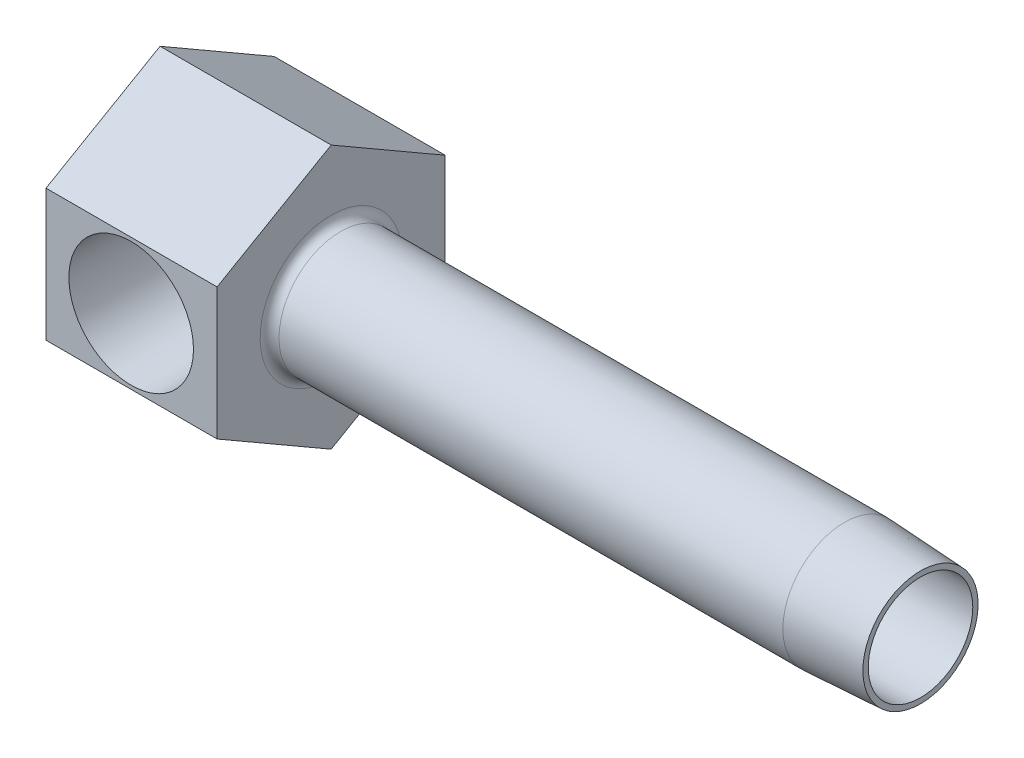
ISO-10303-21;
HEADER;
FILE_DESCRIPTION(('STEP AP214'),'2;1');
FILE_NAME('part.step','',(''),(''),'','','');
FILE_SCHEMA(('AUTOMOTIVE_DESIGN { 1 0 10303 214 1 1 1 1 }'));
ENDSEC;
DATA;
#1=APPLICATION_CONTEXT('core data for automotive mechanical design processes');
#2=APPLICATION_PROTOCOL_DEFINITION('international standard','automotive_design',2000,#1);
#3=PRODUCT_CONTEXT('',#1,'mechanical');
#4=PRODUCT('Part','Part','',(#3));
#5=PRODUCT_RELATED_PRODUCT_CATEGORY('part','',(#4));
#6=PRODUCT_DEFINITION_FORMATION('','',#4);
#7=PRODUCT_DEFINITION_CONTEXT('part definition',#1,'design');
#8=PRODUCT_DEFINITION('design','',#6,#7);
#9=PRODUCT_DEFINITION_SHAPE('','',#8);
#10=(LENGTH_UNIT() NAMED_UNIT(*) SI_UNIT(.MILLI.,.METRE.));
#11=(NAMED_UNIT(*) PLANE_ANGLE_UNIT() SI_UNIT($,.RADIAN.));
#12=(NAMED_UNIT(*) SI_UNIT($,.STERADIAN.) SOLID_ANGLE_UNIT());
#13=UNCERTAINTY_MEASURE_WITH_UNIT(LENGTH_MEASURE(1.E-05),#10,'distance_accuracy_value','');
#14=(GEOMETRIC_REPRESENTATION_CONTEXT(3) GLOBAL_UNCERTAINTY_ASSIGNED_CONTEXT((#13)) GLOBAL_UNIT_ASSIGNED_CONTEXT((#10,
#11,#12)) REPRESENTATION_CONTEXT('',''));
#15=CARTESIAN_POINT('',(0.,0.,0.));
#16=DIRECTION('',(0.,0.,1.));
#17=DIRECTION('',(1.,0.,0.));
#18=AXIS2_PLACEMENT_3D('',#15,#16,#17);
#19=CARTESIAN_POINT('',(7.14375,0.,9.525));
#20=DIRECTION('',(1.,0.,0.));
#21=DIRECTION('',(0.,0.,-1.));
#22=AXIS2_PLACEMENT_3D('',#19,#20,#21);
#23=PLANE('',#22);
#24=DIRECTION('',(0.,0.,1.));
#25=VECTOR('',#24,1.);
#26=CARTESIAN_POINT('',(7.14375,4.21628045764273,19.05));
#27=LINE('',#26,#25);
#28=CARTESIAN_POINT('',(7.14375,4.21628045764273,8.39289543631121));
#29=VERTEX_POINT('',#28);
#30=CARTESIAN_POINT('',(7.14375,4.21628045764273,10.16));
#31=VERTEX_POINT('',#30);
#32=EDGE_CURVE('E274',#29,#31,#27,.T.);
#33=ORIENTED_EDGE('',*,*,#32,.F.);
#34=CARTESIAN_POINT('',(7.14375,0.,9.525));
#35=DIRECTION('',(1.,0.,0.));
#36=DIRECTION('',(0.,0.,-1.));
#37=AXIS2_PLACEMENT_3D('',#34,#35,#36);
#38=CIRCLE('',#37,4.365625);
#39=CARTESIAN_POINT('',(7.14375,4.31919629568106,10.16));
#40=VERTEX_POINT('',#39);
#41=EDGE_CURVE('E162',#29,#40,#38,.T.);
#42=ORIENTED_EDGE('',*,*,#41,.T.);
#43=DIRECTION('',(0.,1.,0.));
#44=VECTOR('',#43,1.);
#45=CARTESIAN_POINT('',(7.14375,0.,10.16));
#46=LINE('',#45,#44);
#47=EDGE_CURVE('E153',#31,#40,#46,.T.);
#48=ORIENTED_EDGE('',*,*,#47,.F.);
#49=EDGE_LOOP('',(#33,#42,#48));
#50=FACE_BOUND('',#49,.T.);
#51=ADVANCED_FACE('F15',(#50),#23,.T.);
#52=CARTESIAN_POINT('',(63.5,0.,4.71428939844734));
#53=DIRECTION('',(-1.,0.,0.));
#54=DIRECTION('',(0.,0.,1.));
#55=AXIS2_PLACEMENT_3D('',#52,#53,#54);
#56=PLANE('',#55);
#57=CARTESIAN_POINT('',(63.5,0.,9.525));
#58=DIRECTION('',(-1.,0.,0.));
#59=DIRECTION('',(0.,0.,1.));
#60=AXIS2_PLACEMENT_3D('',#57,#58,#59);
#61=CIRCLE('',#60,4.81071060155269);
#62=CARTESIAN_POINT('',(63.5,0.,14.3357106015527));
#63=VERTEX_POINT('',#62);
#64=EDGE_CURVE('E172',#63,#63,#61,.T.);
#65=ORIENTED_EDGE('',*,*,#64,.F.);
#66=EDGE_LOOP('',(#65));
#67=FACE_BOUND('',#66,.T.);
#68=CARTESIAN_POINT('',(63.5,0.,9.525));
#69=DIRECTION('',(1.,0.,0.));
#70=DIRECTION('',(0.,0.,-1.));
#71=AXIS2_PLACEMENT_3D('',#68,#69,#70);
#72=CIRCLE('',#71,4.365625);
#73=CARTESIAN_POINT('',(63.5,0.,5.159375));
#74=VERTEX_POINT('',#73);
#75=EDGE_CURVE('E163',#74,#74,#72,.T.);
#76=ORIENTED_EDGE('',*,*,#75,.F.);
#77=EDGE_LOOP('',(#76));
#78=FACE_BOUND('',#77,.T.);
#79=ADVANCED_FACE('F118',(#67,#78),#56,.F.);
#80=CARTESIAN_POINT('',(14.2875,5.4992613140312,19.05));
#81=DIRECTION('',(0.,0.,-1.));
#82=DIRECTION('',(-1.,0.,0.));
#83=AXIS2_PLACEMENT_3D('',#80,#81,#82);
#84=PLANE('',#83);
#85=CARTESIAN_POINT('',(7.112,0.,19.05));
#86=DIRECTION('',(0.,0.,1.));
#87=DIRECTION('',(1.,0.,0.));
#88=AXIS2_PLACEMENT_3D('',#85,#86,#87);
#89=CIRCLE('',#88,5.2023645);
#90=CARTESIAN_POINT('',(12.3143645,0.,19.05));
#91=VERTEX_POINT('',#90);
#92=EDGE_CURVE('E265',#91,#91,#89,.T.);
#93=ORIENTED_EDGE('',*,*,#92,.F.);
#94=EDGE_LOOP('',(#93));
#95=FACE_BOUND('',#94,.T.);
#96=DIRECTION('',(0.,-1.,0.));
#97=VECTOR('',#96,1.);
#98=CARTESIAN_POINT('',(0.,5.4992613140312,19.05));
#99=LINE('',#98,#97);
#100=CARTESIAN_POINT('',(0.,5.4992613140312,19.05));
#101=VERTEX_POINT('',#100);
#102=CARTESIAN_POINT('',(0.,-5.49926131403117,19.05));
#103=VERTEX_POINT('',#102);
#104=EDGE_CURVE('E185',#101,#103,#99,.T.);
#105=ORIENTED_EDGE('',*,*,#104,.T.);
#106=DIRECTION('',(-1.,0.,0.));
#107=VECTOR('',#106,1.);
#108=CARTESIAN_POINT('',(14.2875,-5.49926131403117,19.05));
#109=LINE('',#108,#107);
#110=CARTESIAN_POINT('',(14.2875,-5.49926131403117,19.05));
#111=VERTEX_POINT('',#110);
#112=EDGE_CURVE('E208',#111,#103,#109,.T.);
#113=ORIENTED_EDGE('',*,*,#112,.F.);
#114=DIRECTION('',(0.,-1.,0.));
#115=VECTOR('',#114,1.);
#116=CARTESIAN_POINT('',(14.2875,5.4992613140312,19.05));
#117=LINE('',#116,#115);
#118=CARTESIAN_POINT('',(14.2875,5.4992613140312,19.05));
#119=VERTEX_POINT('',#118);
#120=EDGE_CURVE('E201',#119,#111,#117,.T.);
#121=ORIENTED_EDGE('',*,*,#120,.F.);
#122=DIRECTION('',(-1.,0.,0.));
#123=VECTOR('',#122,1.);
#124=CARTESIAN_POINT('',(14.2875,5.4992613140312,19.05));
#125=LINE('',#124,#123);
#126=EDGE_CURVE('E211',#119,#101,#125,.T.);
#127=ORIENTED_EDGE('',*,*,#126,.T.);
#128=EDGE_LOOP('',(#105,#113,#121,#127));
#129=FACE_BOUND('',#128,.T.);
#130=ADVANCED_FACE('F126',(#95,#129),#84,.F.);
#131=CARTESIAN_POINT('',(14.2875,-5.49926131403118,0.));
#132=DIRECTION('',(1.,0.,0.));
#133=DIRECTION('',(0.,1.,0.));
#134=AXIS2_PLACEMENT_3D('',#131,#132,#133);
#135=PLANE('',#134);
#136=CARTESIAN_POINT('',(14.2875,0.,9.525));
#137=DIRECTION('',(1.,0.,0.));
#138=DIRECTION('',(0.,1.,0.));
#139=AXIS2_PLACEMENT_3D('',#136,#137,#138);
#140=CIRCLE('',#139,5.9309);
#141=CARTESIAN_POINT('',(14.2875,5.9309,9.525));
#142=VERTEX_POINT('',#141);
#143=EDGE_CURVE('E223',#142,#142,#140,.F.);
#144=ORIENTED_EDGE('',*,*,#143,.T.);
#145=EDGE_LOOP('',(#144));
#146=FACE_BOUND('',#145,.T.);
#147=DIRECTION('',(0.,0.5,-0.866025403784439));
#148=VECTOR('',#147,1.);
#149=CARTESIAN_POINT('',(14.2875,-10.9985226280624,9.525));
#150=LINE('',#149,#148);
#151=CARTESIAN_POINT('',(14.2875,-10.9985226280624,9.525));
#152=VERTEX_POINT('',#151);
#153=CARTESIAN_POINT('',(14.2875,-5.49926131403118,0.));
#154=VERTEX_POINT('',#153);
#155=EDGE_CURVE('E191',#152,#154,#150,.T.);
#156=ORIENTED_EDGE('',*,*,#155,.T.);
#157=DIRECTION('',(0.,1.,0.));
#158=VECTOR('',#157,1.);
#159=CARTESIAN_POINT('',(14.2875,-5.49926131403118,0.));
#160=LINE('',#159,#158);
#161=CARTESIAN_POINT('',(14.2875,5.49926131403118,0.));
#162=VERTEX_POINT('',#161);
#163=EDGE_CURVE('E195',#154,#162,#160,.T.);
#164=ORIENTED_EDGE('',*,*,#163,.T.);
#165=DIRECTION('',(0.,0.5,0.866025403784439));
#166=VECTOR('',#165,1.);
#167=CARTESIAN_POINT('',(14.2875,5.49926131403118,0.));
#168=LINE('',#167,#166);
#169=CARTESIAN_POINT('',(14.2875,10.9985226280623,9.525));
#170=VERTEX_POINT('',#169);
#171=EDGE_CURVE('E197',#162,#170,#168,.T.);
#172=ORIENTED_EDGE('',*,*,#171,.T.);
#173=DIRECTION('',(0.,-0.5,0.86602540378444));
#174=VECTOR('',#173,1.);
#175=CARTESIAN_POINT('',(14.2875,10.9985226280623,9.525));
#176=LINE('',#175,#174);
#177=EDGE_CURVE('E199',#170,#119,#176,.T.);
#178=ORIENTED_EDGE('',*,*,#177,.T.);
#179=ORIENTED_EDGE('',*,*,#120,.T.);
#180=DIRECTION('',(0.,-0.5,-0.866025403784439));
#181=VECTOR('',#180,1.);
#182=CARTESIAN_POINT('',(14.2875,-5.49926131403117,19.05));
#183=LINE('',#182,#181);
#184=EDGE_CURVE('E38',#111,#152,#183,.T.);
#185=ORIENTED_EDGE('',*,*,#184,.T.);
#186=EDGE_LOOP('',(#156,#164,#172,#178,#179,#185));
#187=FACE_BOUND('',#186,.T.);
#188=ADVANCED_FACE('F281',(#146,#187),#135,.T.);
#189=CARTESIAN_POINT('',(14.2875,-10.9985226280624,9.525));
#190=DIRECTION('',(0.,0.866025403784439,0.5));
#191=DIRECTION('',(0.,-0.5,0.866025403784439));
#192=AXIS2_PLACEMENT_3D('',#189,#190,#191);
#193=PLANE('',#192);
#194=DIRECTION('',(0.,0.5,-0.866025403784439));
#195=VECTOR('',#194,1.);
#196=CARTESIAN_POINT('',(0.,-10.9985226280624,9.525));
#197=LINE('',#196,#195);
#198=CARTESIAN_POINT('',(0.,-10.9985226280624,9.525));
#199=VERTEX_POINT('',#198);
#200=CARTESIAN_POINT('',(0.,-5.49926131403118,0.));
#201=VERTEX_POINT('',#200);
#202=EDGE_CURVE('E175',#199,#201,#197,.T.);
#203=ORIENTED_EDGE('',*,*,#202,.T.);
#204=DIRECTION('',(-1.,0.,0.));
#205=VECTOR('',#204,1.);
#206=CARTESIAN_POINT('',(14.2875,-5.49926131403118,0.));
#207=LINE('',#206,#205);
#208=EDGE_CURVE('E220',#154,#201,#207,.T.);
#209=ORIENTED_EDGE('',*,*,#208,.F.);
#210=ORIENTED_EDGE('',*,*,#155,.F.);
#211=DIRECTION('',(-1.,0.,0.));
#212=VECTOR('',#211,1.);
#213=CARTESIAN_POINT('',(14.2875,-10.9985226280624,9.525));
#214=LINE('',#213,#212);
#215=EDGE_CURVE('E204',#152,#199,#214,.T.);
#216=ORIENTED_EDGE('',*,*,#215,.T.);
#217=EDGE_LOOP('',(#203,#209,#210,#216));
#218=FACE_BOUND('',#217,.T.);
#219=ADVANCED_FACE('F17',(#218),#193,.F.);
#220=CARTESIAN_POINT('',(14.2875,-5.49926131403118,0.));
#221=DIRECTION('',(0.,0.,1.));
#222=DIRECTION('',(0.,-1.,0.));
#223=AXIS2_PLACEMENT_3D('',#220,#221,#222);
#224=PLANE('',#223);
#225=DIRECTION('',(0.,1.,0.));
#226=VECTOR('',#225,1.);
#227=CARTESIAN_POINT('',(0.,-5.49926131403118,0.));
#228=LINE('',#227,#226);
#229=CARTESIAN_POINT('',(0.,5.49926131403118,0.));
#230=VERTEX_POINT('',#229);
#231=EDGE_CURVE('E176',#201,#230,#228,.T.);
#232=ORIENTED_EDGE('',*,*,#231,.T.);
#233=DIRECTION('',(-1.,0.,0.));
#234=VECTOR('',#233,1.);
#235=CARTESIAN_POINT('',(14.2875,5.49926131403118,0.));
#236=LINE('',#235,#234);
#237=EDGE_CURVE('E217',#162,#230,#236,.T.);
#238=ORIENTED_EDGE('',*,*,#237,.F.);
#239=ORIENTED_EDGE('',*,*,#163,.F.);
#240=ORIENTED_EDGE('',*,*,#208,.T.);
#241=EDGE_LOOP('',(#232,#238,#239,#240));
#242=FACE_BOUND('',#241,.T.);
#243=ADVANCED_FACE('F302',(#242),#224,.F.);
#244=CARTESIAN_POINT('',(14.2875,5.49926131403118,0.));
#245=DIRECTION('',(0.,-0.866025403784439,0.5));
#246=DIRECTION('',(0.,-0.5,-0.866025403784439));
#247=AXIS2_PLACEMENT_3D('',#244,#245,#246);
#248=PLANE('',#247);
#249=DIRECTION('',(0.,0.5,0.866025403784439));
#250=VECTOR('',#249,1.);
#251=CARTESIAN_POINT('',(0.,5.49926131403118,0.));
#252=LINE('',#251,#250);
#253=CARTESIAN_POINT('',(0.,10.9985226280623,9.525));
#254=VERTEX_POINT('',#253);
#255=EDGE_CURVE('E179',#230,#254,#252,.T.);
#256=ORIENTED_EDGE('',*,*,#255,.T.);
#257=DIRECTION('',(-1.,0.,0.));
#258=VECTOR('',#257,1.);
#259=CARTESIAN_POINT('',(14.2875,10.9985226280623,9.525));
#260=LINE('',#259,#258);
#261=EDGE_CURVE('E214',#170,#254,#260,.T.);
#262=ORIENTED_EDGE('',*,*,#261,.F.);
#263=ORIENTED_EDGE('',*,*,#171,.F.);
#264=ORIENTED_EDGE('',*,*,#237,.T.);
#265=EDGE_LOOP('',(#256,#262,#263,#264));
#266=FACE_BOUND('',#265,.T.);
#267=ADVANCED_FACE('F304',(#266),#248,.F.);
#268=CARTESIAN_POINT('',(14.2875,10.9985226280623,9.525));
#269=DIRECTION('',(0.,-0.86602540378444,-0.5));
#270=DIRECTION('',(0.,0.5,-0.86602540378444));
#271=AXIS2_PLACEMENT_3D('',#268,#269,#270);
#272=PLANE('',#271);
#273=DIRECTION('',(0.,-0.5,0.86602540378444));
#274=VECTOR('',#273,1.);
#275=CARTESIAN_POINT('',(0.,10.9985226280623,9.525));
#276=LINE('',#275,#274);
#277=EDGE_CURVE('E182',#254,#101,#276,.T.);
#278=ORIENTED_EDGE('',*,*,#277,.T.);
#279=ORIENTED_EDGE('',*,*,#126,.F.);
#280=ORIENTED_EDGE('',*,*,#177,.F.);
#281=ORIENTED_EDGE('',*,*,#261,.T.);
#282=EDGE_LOOP('',(#278,#279,#280,#281));
#283=FACE_BOUND('',#282,.T.);
#284=ADVANCED_FACE('F307',(#283),#272,.F.);
#285=CARTESIAN_POINT('',(14.2875,-5.49926131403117,19.05));
#286=DIRECTION('',(0.,0.866025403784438,-0.5));
#287=DIRECTION('',(0.,0.5,0.866025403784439));
#288=AXIS2_PLACEMENT_3D('',#285,#286,#287);
#289=PLANE('',#288);
#290=DIRECTION('',(0.,-0.5,-0.866025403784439));
#291=VECTOR('',#290,1.);
#292=CARTESIAN_POINT('',(0.,-5.49926131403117,19.05));
#293=LINE('',#292,#291);
#294=EDGE_CURVE('E188',#103,#199,#293,.T.);
#295=ORIENTED_EDGE('',*,*,#294,.T.);
#296=ORIENTED_EDGE('',*,*,#215,.F.);
#297=ORIENTED_EDGE('',*,*,#184,.F.);
#298=ORIENTED_EDGE('',*,*,#112,.T.);
#299=EDGE_LOOP('',(#295,#296,#297,#298));
#300=FACE_BOUND('',#299,.T.);
#301=ADVANCED_FACE('F291',(#300),#289,.F.);
#302=CARTESIAN_POINT('',(0.,-5.49926131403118,0.));
#303=DIRECTION('',(1.,0.,0.));
#304=DIRECTION('',(0.,1.,0.));
#305=AXIS2_PLACEMENT_3D('',#302,#303,#304);
#306=PLANE('',#305);
#307=ORIENTED_EDGE('',*,*,#202,.F.);
#308=ORIENTED_EDGE('',*,*,#294,.F.);
#309=ORIENTED_EDGE('',*,*,#104,.F.);
#310=ORIENTED_EDGE('',*,*,#277,.F.);
#311=ORIENTED_EDGE('',*,*,#255,.F.);
#312=ORIENTED_EDGE('',*,*,#231,.F.);
#313=EDGE_LOOP('',(#307,#308,#309,#310,#311,#312));
#314=FACE_BOUND('',#313,.T.);
#315=ADVANCED_FACE('F293',(#314),#306,.F.);
#316=CARTESIAN_POINT('',(68.0114010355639,0.,9.525));
#317=DIRECTION('',(-1.,0.,0.));
#318=DIRECTION('',(0.,0.,1.));
#319=AXIS2_PLACEMENT_3D('',#316,#317,#318);
#320=CYLINDRICAL_SURFACE('',#319,5.1435);
#321=CARTESIAN_POINT('',(15.0749,0.,9.525));
#322=DIRECTION('',(1.,0.,0.));
#323=DIRECTION('',(0.,1.,0.));
#324=AXIS2_PLACEMENT_3D('',#321,#322,#323);
#325=CIRCLE('',#324,5.1435);
#326=CARTESIAN_POINT('',(15.0749,5.1435,9.525));
#327=VERTEX_POINT('',#326);
#328=EDGE_CURVE('E226',#327,#327,#325,.T.);
#329=ORIENTED_EDGE('',*,*,#328,.T.);
#330=EDGE_LOOP('',(#329));
#331=FACE_BOUND('',#330,.T.);
#332=CARTESIAN_POINT('',(57.15,0.,9.525));
#333=DIRECTION('',(-1.,0.,0.));
#334=DIRECTION('',(0.,0.,1.));
#335=AXIS2_PLACEMENT_3D('',#332,#333,#334);
#336=CIRCLE('',#335,5.1435);
#337=CARTESIAN_POINT('',(57.15,0.,14.6685));
#338=VERTEX_POINT('',#337);
#339=EDGE_CURVE('E166',#338,#338,#336,.T.);
#340=ORIENTED_EDGE('',*,*,#339,.T.);
#341=EDGE_LOOP('',(#340));
#342=FACE_BOUND('',#341,.T.);
#343=ADVANCED_FACE('F141',(#331,#342),#320,.T.);
#344=CARTESIAN_POINT('',(63.5,0.,9.525));
#345=DIRECTION('',(-1.,0.,0.));
#346=DIRECTION('',(0.,0.,1.));
#347=AXIS2_PLACEMENT_3D('',#344,#345,#346);
#348=CONICAL_SURFACE('',#347,4.81071060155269,0.0523598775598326);
#349=ORIENTED_EDGE('',*,*,#339,.F.);
#350=EDGE_LOOP('',(#349));
#351=FACE_BOUND('',#350,.T.);
#352=ORIENTED_EDGE('',*,*,#64,.T.);
#353=EDGE_LOOP('',(#352));
#354=FACE_BOUND('',#353,.T.);
#355=ADVANCED_FACE('F133',(#351,#354),#348,.T.);
#356=CARTESIAN_POINT('',(7.14375,-4.31919629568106,10.16));
#357=VERTEX_POINT('',#356);
#358=CARTESIAN_POINT('',(7.14375,-4.21628045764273,10.16));
#359=VERTEX_POINT('',#358);
#360=EDGE_CURVE('E146',#357,#359,#46,.T.);
#361=ORIENTED_EDGE('',*,*,#360,.F.);
#362=CARTESIAN_POINT('',(7.14375,-4.21628045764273,8.39289543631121));
#363=VERTEX_POINT('',#362);
#364=EDGE_CURVE('E148',#357,#363,#38,.T.);
#365=ORIENTED_EDGE('',*,*,#364,.T.);
#366=DIRECTION('',(0.,0.,1.));
#367=VECTOR('',#366,1.);
#368=CARTESIAN_POINT('',(7.14375,-4.21628045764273,19.05));
#369=LINE('',#368,#367);
#370=EDGE_CURVE('E149',#359,#363,#369,.F.);
#371=ORIENTED_EDGE('',*,*,#370,.F.);
#372=EDGE_LOOP('',(#361,#365,#371));
#373=FACE_BOUND('',#372,.T.);
#374=ADVANCED_FACE('F121',(#373),#23,.T.);
#375=CARTESIAN_POINT('',(66.1375087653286,0.,9.525));
#376=DIRECTION('',(1.,0.,0.));
#377=DIRECTION('',(0.,0.,-1.));
#378=AXIS2_PLACEMENT_3D('',#375,#376,#377);
#379=CYLINDRICAL_SURFACE('',#378,4.365625);
#380=DIRECTION('',(1.,0.,0.));
#381=VECTOR('',#380,1.);
#382=CARTESIAN_POINT('',(66.1375087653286,4.31919629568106,10.16));
#383=LINE('',#382,#381);
#384=CARTESIAN_POINT('',(9.50166012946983,4.31919629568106,10.16));
#385=VERTEX_POINT('',#384);
#386=EDGE_CURVE('E10',#40,#385,#383,.T.);
#387=ORIENTED_EDGE('',*,*,#386,.F.);
#388=ORIENTED_EDGE('',*,*,#41,.F.);
#389=CARTESIAN_POINT('',(11.0152606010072,1.5945487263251,5.461));
#390=CARTESIAN_POINT('',(10.9690910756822,1.7075595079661,5.50534166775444));
#391=CARTESIAN_POINT('',(10.9186455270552,1.81703423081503,5.55373339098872));
#392=CARTESIAN_POINT('',(10.810302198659,2.02846645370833,5.65746242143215));
#393=CARTESIAN_POINT('',(10.7524192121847,2.13043826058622,5.71278593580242));
#394=CARTESIAN_POINT('',(10.5698905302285,2.42358040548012,5.88682744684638));
#395=CARTESIAN_POINT('',(10.4356317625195,2.6037024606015,6.01432367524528));
#396=CARTESIAN_POINT('',(10.2004726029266,2.87382153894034,6.2358690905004));
#397=CARTESIAN_POINT('',(10.1051285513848,2.97281573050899,6.32528321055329));
#398=CARTESIAN_POINT('',(9.90783434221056,3.15907014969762,6.50903483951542));
#399=CARTESIAN_POINT('',(9.80588273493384,3.2463277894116,6.60337342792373));
#400=CARTESIAN_POINT('',(9.59613587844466,3.40951469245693,6.79556583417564));
#401=CARTESIAN_POINT('',(9.48833347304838,3.48542963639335,6.89342390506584));
#402=CARTESIAN_POINT('',(9.26745878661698,3.62617881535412,7.09103053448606));
#403=CARTESIAN_POINT('',(9.15438825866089,3.69101670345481,7.19077845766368));
#404=CARTESIAN_POINT('',(8.91700112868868,3.81296593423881,7.39547820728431));
#405=CARTESIAN_POINT('',(8.79240497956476,3.86952009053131,7.50043788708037));
#406=CARTESIAN_POINT('',(8.53587575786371,3.97111492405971,7.70779573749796));
#407=CARTESIAN_POINT('',(8.40392330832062,4.01612325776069,7.81018600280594));
#408=CARTESIAN_POINT('',(8.16304729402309,4.0847277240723,7.98226690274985));
#409=CARTESIAN_POINT('',(8.0562781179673,4.11086974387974,8.05387458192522));
#410=CARTESIAN_POINT('',(7.89027521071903,4.14432560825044,8.15224503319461));
#411=CARTESIAN_POINT('',(7.83425575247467,4.15448196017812,8.18339689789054));
#412=CARTESIAN_POINT('',(7.71975817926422,4.17277321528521,8.24142733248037));
#413=CARTESIAN_POINT('',(7.6612817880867,4.18090950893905,8.26830883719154));
#414=CARTESIAN_POINT('',(7.52931857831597,4.19631734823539,8.32062856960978));
#415=CARTESIAN_POINT('',(7.45518069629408,4.2030846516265,8.34468558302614));
#416=CARTESIAN_POINT('',(7.30234246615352,4.21282137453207,8.37996487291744));
#417=CARTESIAN_POINT('',(7.22358315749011,4.21571837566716,8.39094201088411));
#418=CARTESIAN_POINT('',(7.14374999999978,4.21628045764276,8.39289543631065));
#419=B_SPLINE_CURVE_WITH_KNOTS('',3,(#389,#390,#391,#392,#393,#394,#395,#396,#397,#398,#399,
#400,#401,#402,#403,#404,#405,#406,#407,#408,#409,#410,#411,#412,#413,#414,#415,#416,#417,#418),
.UNSPECIFIED.,.F.,.F.,(4,2,2,2,2,2,2,2,2,2,2,2,2,2,4),(0.,0.389178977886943,0.777595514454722,
1.54850925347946,2.03989074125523,2.5313804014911,3.02348538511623,3.51542776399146,
4.03226982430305,4.5505442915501,4.94339994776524,5.13792303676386,5.33231185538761,
5.56585330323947,5.80370611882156),.UNSPECIFIED.);
#420=CARTESIAN_POINT('',(11.0152606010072,1.5945487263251,5.461));
#421=VERTEX_POINT('',#420);
#422=EDGE_CURVE('E229',#421,#29,#419,.T.);
#423=ORIENTED_EDGE('',*,*,#422,.F.);
#424=CARTESIAN_POINT('',(11.038608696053,-1.66986531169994,5.4913625));
#425=CARTESIAN_POINT('',(11.0105354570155,-1.5831922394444,5.45544731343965));
#426=CARTESIAN_POINT('',(10.985979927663,-1.49442111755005,5.422003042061));
#427=CARTESIAN_POINT('',(10.9431209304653,-1.31365154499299,5.36062405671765));
#428=CARTESIAN_POINT('',(10.9248095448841,-1.22165734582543,5.3326823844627));
#429=CARTESIAN_POINT('',(10.8936059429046,-1.03529168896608,5.28281066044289));
#430=CARTESIAN_POINT('',(10.8807075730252,-0.94092306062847,5.26087379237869));
#431=CARTESIAN_POINT('',(10.8594086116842,-0.750424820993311,5.22325970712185));
#432=CARTESIAN_POINT('',(10.8510094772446,-0.654294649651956,5.20758451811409));
#433=CARTESIAN_POINT('',(10.8381415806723,-0.463156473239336,5.18296779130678));
#434=CARTESIAN_POINT('',(10.8335877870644,-0.368172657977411,5.1738812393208));
#435=CARTESIAN_POINT('',(10.8276558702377,-0.177678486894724,5.16194794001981));
#436=CARTESIAN_POINT('',(10.8262790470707,-0.0821679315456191,5.15910374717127));
#437=CARTESIAN_POINT('',(10.826564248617,0.108822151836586,5.15968693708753));
#438=CARTESIAN_POINT('',(10.828226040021,0.204301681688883,5.16311383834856));
#439=CARTESIAN_POINT('',(10.8347557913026,0.3946850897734,5.17620642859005));
#440=CARTESIAN_POINT('',(10.8396224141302,0.489589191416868,5.18586951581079));
#441=CARTESIAN_POINT('',(10.8530224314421,0.678329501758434,5.2113452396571));
#442=CARTESIAN_POINT('',(10.861556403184,0.772165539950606,5.22715884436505));
#443=CARTESIAN_POINT('',(10.882977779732,0.958108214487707,5.26475262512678));
#444=CARTESIAN_POINT('',(10.8958637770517,1.05021539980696,5.28653087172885));
#445=CARTESIAN_POINT('',(10.9268394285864,1.23213175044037,5.33579934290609));
#446=CARTESIAN_POINT('',(10.9449350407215,1.32193815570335,5.36329609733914));
#447=CARTESIAN_POINT('',(10.9870994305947,1.49845562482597,5.42352620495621));
#448=CARTESIAN_POINT('',(11.0111754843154,1.58516276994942,5.45626591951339));
#449=CARTESIAN_POINT('',(11.038608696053,1.66986531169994,5.4913625));
#450=B_SPLINE_CURVE_WITH_KNOTS('',3,(#424,#425,#426,#427,#428,#429,#430,#431,#432,#433,#434,
#435,#436,#437,#438,#439,#440,#441,#442,#443,#444,#445,#446,#447,#448,#449),.UNSPECIFIED.,.F.,
.F.,(4,2,2,2,2,2,2,2,2,2,2,2,4),(0.,0.293591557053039,0.586809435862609,0.879693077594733,
1.17267150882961,1.45898777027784,1.74542117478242,2.03183258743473,2.31812458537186,
2.60446166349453,2.89070622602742,3.17727945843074,3.46420306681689),.UNSPECIFIED.);
#451=CARTESIAN_POINT('',(11.0152606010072,-1.5945487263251,5.461));
#452=VERTEX_POINT('',#451);
#453=EDGE_CURVE('E234',#452,#421,#450,.T.);
#454=ORIENTED_EDGE('',*,*,#453,.F.);
#455=CARTESIAN_POINT('',(7.14375,-4.21628045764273,8.39289543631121));
#456=CARTESIAN_POINT('',(7.18362399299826,-4.21598583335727,8.39181806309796));
#457=CARTESIAN_POINT('',(7.22338201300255,-4.21511517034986,8.38855660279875));
#458=CARTESIAN_POINT('',(7.30220974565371,-4.21229002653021,8.3781194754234));
#459=CARTESIAN_POINT('',(7.34128135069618,-4.21033927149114,8.37095726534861));
#460=CARTESIAN_POINT('',(7.45558593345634,-4.20306181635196,8.34463096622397));
#461=CARTESIAN_POINT('',(7.52959005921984,-4.19629141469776,8.32054287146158));
#462=CARTESIAN_POINT('',(7.67793141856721,-4.17895935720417,8.2616842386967));
#463=CARTESIAN_POINT('',(7.75200183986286,-4.16818767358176,8.22634138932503));
#464=CARTESIAN_POINT('',(7.89635080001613,-4.14345087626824,8.14945009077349));
#465=CARTESIAN_POINT('',(7.96662283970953,-4.12948049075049,8.10789143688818));
#466=CARTESIAN_POINT('',(8.10525974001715,-4.09836535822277,8.02024615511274));
#467=CARTESIAN_POINT('',(8.17357097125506,-4.08117012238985,7.97409391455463));
#468=CARTESIAN_POINT('',(8.30769836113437,-4.04390532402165,7.87936489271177));
#469=CARTESIAN_POINT('',(8.37351346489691,-4.02383456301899,7.83078710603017));
#470=CARTESIAN_POINT('',(8.57859672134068,-3.95588469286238,7.67482924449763));
#471=CARTESIAN_POINT('',(8.71418056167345,-3.90283307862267,7.56482866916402));
#472=CARTESIAN_POINT('',(8.97841531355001,-3.78358080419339,7.34346052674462));
#473=CARTESIAN_POINT('',(9.10705932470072,-3.71736735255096,7.23209172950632));
#474=CARTESIAN_POINT('',(9.35705912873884,-3.57190642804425,7.01153592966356));
#475=CARTESIAN_POINT('',(9.47845600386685,-3.49274436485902,6.90233956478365));
#476=CARTESIAN_POINT('',(9.71438396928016,-3.32067953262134,6.68762551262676));
#477=CARTESIAN_POINT('',(9.82891987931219,-3.22778657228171,6.58210526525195));
#478=CARTESIAN_POINT('',(10.0969445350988,-2.98549279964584,6.33327532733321));
#479=CARTESIAN_POINT('',(10.2465325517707,-2.82876640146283,6.19275827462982));
#480=CARTESIAN_POINT('',(10.5251240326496,-2.48539491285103,5.92944140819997));
#481=CARTESIAN_POINT('',(10.6541872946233,-2.29884003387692,5.80659022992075));
#482=CARTESIAN_POINT('',(10.815064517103,-2.01834728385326,5.65289947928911));
#483=CARTESIAN_POINT('',(10.8584525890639,-1.93670806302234,5.61137999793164));
#484=CARTESIAN_POINT('',(10.9405236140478,-1.76894321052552,5.53274400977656));
#485=CARTESIAN_POINT('',(10.9792015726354,-1.6828129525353,5.49563217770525));
#486=CARTESIAN_POINT('',(11.0152606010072,-1.5945487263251,5.461));
#487=B_SPLINE_CURVE_WITH_KNOTS('',3,(#455,#456,#457,#458,#459,#460,#461,#462,#463,#464,#465,
#466,#467,#468,#469,#470,#471,#472,#473,#474,#475,#476,#477,#478,#479,#480,#481,#482,#483,#484,
#485,#486),.UNSPECIFIED.,.F.,.F.,(4,2,2,2,2,2,2,2,2,2,2,2,2,2,2,4),(0.,0.119524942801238,
0.238640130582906,0.471907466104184,0.719716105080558,0.967936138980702,1.2204276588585,
1.47302472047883,2.01967972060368,2.56686861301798,3.1105838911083,3.65391262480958,
4.4259772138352,5.19574951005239,5.49953103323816,5.80363192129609),.UNSPECIFIED.);
#488=EDGE_CURVE('E161',#363,#452,#487,.T.);
#489=ORIENTED_EDGE('',*,*,#488,.F.);
#490=ORIENTED_EDGE('',*,*,#364,.F.);
#491=DIRECTION('',(1.,0.,0.));
#492=VECTOR('',#491,1.);
#493=CARTESIAN_POINT('',(66.1375087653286,-4.31919629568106,10.16));
#494=LINE('',#493,#492);
#495=CARTESIAN_POINT('',(9.50166012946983,-4.31919629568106,10.16));
#496=VERTEX_POINT('',#495);
#497=EDGE_CURVE('E23',#496,#357,#494,.F.);
#498=ORIENTED_EDGE('',*,*,#497,.F.);
#499=CARTESIAN_POINT('',(9.50159462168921,4.31922569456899,10.1598));
#500=CARTESIAN_POINT('',(9.52205476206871,4.31004461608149,10.2222542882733));
#501=CARTESIAN_POINT('',(9.54440879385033,4.29961032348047,10.2838517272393));
#502=CARTESIAN_POINT('',(9.592244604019,4.27639816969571,10.4052958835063));
#503=CARTESIAN_POINT('',(9.61772301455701,4.26362282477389,10.4651444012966));
#504=CARTESIAN_POINT('',(9.6977084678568,4.22211002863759,10.641720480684));
#505=CARTESIAN_POINT('',(9.75594525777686,4.19010742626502,10.7559937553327));
#506=CARTESIAN_POINT('',(9.87844694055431,4.11827910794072,10.9783012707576));
#507=CARTESIAN_POINT('',(9.94270165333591,4.07846648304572,11.0863455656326));
#508=CARTESIAN_POINT('',(10.0748723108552,3.9913538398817,11.2972300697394));
#509=CARTESIAN_POINT('',(10.1427929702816,3.94404402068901,11.4000632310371));
#510=CARTESIAN_POINT('',(10.298774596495,3.82856370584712,11.6276502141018));
#511=CARTESIAN_POINT('',(10.3873705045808,3.75819622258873,11.7509249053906));
#512=CARTESIAN_POINT('',(10.5646676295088,3.60591330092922,11.9899830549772));
#513=CARTESIAN_POINT('',(10.6533688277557,3.52399966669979,12.1057676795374));
#514=CARTESIAN_POINT('',(10.828903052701,3.34837324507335,12.3298815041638));
#515=CARTESIAN_POINT('',(10.9157338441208,3.25464716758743,12.4382020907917));
#516=CARTESIAN_POINT('',(11.0854790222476,3.05533823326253,12.6465978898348));
#517=CARTESIAN_POINT('',(11.1683947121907,2.94975936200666,12.746675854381));
#518=CARTESIAN_POINT('',(11.3637298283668,2.67738871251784,12.9797077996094));
#519=CARTESIAN_POINT('',(11.4730979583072,2.50408908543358,13.1077769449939));
#520=CARTESIAN_POINT('',(11.6736784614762,2.13317678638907,13.3402290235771));
#521=CARTESIAN_POINT('',(11.764930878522,1.93561933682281,13.444664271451));
#522=CARTESIAN_POINT('',(11.9092563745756,1.55445058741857,13.608817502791));
#523=CARTESIAN_POINT('',(11.9662034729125,1.37434002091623,13.6731460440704));
#524=CARTESIAN_POINT('',(12.036275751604,1.09545803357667,13.7520594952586));
#525=CARTESIAN_POINT('',(12.0570798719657,1.00100886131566,13.7754393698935));
#526=CARTESIAN_POINT('',(12.093196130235,0.80976989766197,13.8159777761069));
#527=CARTESIAN_POINT('',(12.1085105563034,0.712981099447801,13.8331388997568));
#528=CARTESIAN_POINT('',(12.1334016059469,0.517219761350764,13.861011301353));
#529=CARTESIAN_POINT('',(12.1429475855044,0.418238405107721,13.8716881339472));
#530=CARTESIAN_POINT('',(12.1559671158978,0.219418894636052,13.8862461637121));
#531=CARTESIAN_POINT('',(12.159443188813,0.119581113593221,13.8901301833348));
#532=CARTESIAN_POINT('',(12.1602489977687,-0.0801622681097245,13.8910308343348));
#533=CARTESIAN_POINT('',(12.157578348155,-0.180067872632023,13.8880470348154));
#534=CARTESIAN_POINT('',(12.1461610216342,-0.379063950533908,13.87528173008));
#535=CARTESIAN_POINT('',(12.1374146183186,-0.478154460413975,13.8655005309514));
#536=CARTESIAN_POINT('',(12.1041501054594,-0.757548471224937,13.8282625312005));
#537=CARTESIAN_POINT('',(12.0725539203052,-0.936048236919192,13.7928583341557));
#538=CARTESIAN_POINT('',(11.9914510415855,-1.28332325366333,13.701614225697));
#539=CARTESIAN_POINT('',(11.9419389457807,-1.45209555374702,13.645768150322));
#540=CARTESIAN_POINT('',(11.8234161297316,-1.78986703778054,13.5113020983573));
#541=CARTESIAN_POINT('',(11.7531886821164,-1.95786359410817,13.4312490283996));
#542=CARTESIAN_POINT('',(11.5990616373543,-2.2774775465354,13.2539727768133));
#543=CARTESIAN_POINT('',(11.515160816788,-2.42909347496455,13.1567480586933));
#544=CARTESIAN_POINT('',(11.2893838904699,-2.79222476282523,12.8919364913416));
#545=CARTESIAN_POINT('',(11.1405152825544,-2.99235864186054,12.7145443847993));
#546=CARTESIAN_POINT('',(10.9077049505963,-3.26312100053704,12.4281267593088));
#547=CARTESIAN_POINT('',(10.8282461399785,-3.34869576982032,12.3289140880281));
#548=CARTESIAN_POINT('',(10.6676325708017,-3.51003537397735,12.1240974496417));
#549=CARTESIAN_POINT('',(10.5864785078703,-3.58580414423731,12.0184960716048));
#550=CARTESIAN_POINT('',(10.4220303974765,-3.72941202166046,11.798300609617));
#551=CARTESIAN_POINT('',(10.338734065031,-3.79700254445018,11.6835467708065));
#552=CARTESIAN_POINT('',(10.1740816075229,-3.92201333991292,11.4470806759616));
#553=CARTESIAN_POINT('',(10.092727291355,-3.97942442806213,11.3253622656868));
#554=CARTESIAN_POINT('',(9.93568225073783,-4.08324264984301,11.0754774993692));
#555=CARTESIAN_POINT('',(9.85994825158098,-4.12974154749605,10.9473767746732));
#556=CARTESIAN_POINT('',(9.71779756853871,-4.21155620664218,10.6828322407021));
#557=CARTESIAN_POINT('',(9.65135922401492,-4.24689821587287,10.5464089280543));
#558=CARTESIAN_POINT('',(9.57628126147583,-4.28419371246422,10.3652627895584));
#559=CARTESIAN_POINT('',(9.56028735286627,-4.29194911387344,10.3247361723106));
#560=CARTESIAN_POINT('',(9.52977406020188,-4.30640007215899,10.2428664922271));
#561=CARTESIAN_POINT('',(9.51525722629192,-4.31309380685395,10.2015221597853));
#562=CARTESIAN_POINT('',(9.50159462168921,-4.31922569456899,10.1598));
#563=B_SPLINE_CURVE_WITH_KNOTS('',3,(#499,#500,#501,#502,#503,#504,#505,#506,#507,#508,#509,
#510,#511,#512,#513,#514,#515,#516,#517,#518,#519,#520,#521,#522,#523,#524,#525,#526,#527,#528,
#529,#530,#531,#532,#533,#534,#535,#536,#537,#538,#539,#540,#541,#542,#543,#544,#545,#546,#547,
#548,#549,#550,#551,#552,#553,#554,#555,#556,#557,#558,#559,#560,#561,#562),.UNSPECIFIED.,.F.,
.F.,(4,2,2,2,2,2,2,2,2,2,2,2,2,2,2,2,2,2,2,2,2,2,2,2,2,2,2,2,2,2,2,4),(0.,0.19895577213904,
0.397698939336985,0.793542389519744,1.1887279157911,1.58443438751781,2.08580736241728,
2.58710208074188,3.08896592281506,3.5906615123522,4.3128774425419,5.03347872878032,
5.62940645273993,5.92758657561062,6.22564226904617,6.52526772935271,6.82476866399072,
7.12428839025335,7.4237946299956,7.97525228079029,8.52687635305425,9.12138980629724,
9.71595648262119,10.6287987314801,11.0881817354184,11.5473798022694,12.018174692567,
12.4893922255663,12.9564924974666,13.4224855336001,13.5552077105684,13.6881552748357),.UNSPECIFIED.);
#564=EDGE_CURVE('E248',#385,#496,#563,.T.);
#565=ORIENTED_EDGE('',*,*,#564,.F.);
#566=EDGE_LOOP('',(#387,#388,#423,#454,#489,#490,#498,#565));
#567=FACE_BOUND('',#566,.T.);
#568=ORIENTED_EDGE('',*,*,#75,.T.);
#569=EDGE_LOOP('',(#568));
#570=FACE_BOUND('',#569,.T.);
#571=ADVANCED_FACE('F113',(#567,#570),#379,.F.);
#572=CARTESIAN_POINT('',(15.0749,0.,9.525));
#573=DIRECTION('',(1.,0.,0.));
#574=DIRECTION('',(0.,1.,0.));
#575=AXIS2_PLACEMENT_3D('',#572,#573,#574);
#576=TOROIDAL_SURFACE('',#575,5.9309,0.7874);
#577=ORIENTED_EDGE('',*,*,#328,.F.);
#578=EDGE_LOOP('',(#577));
#579=FACE_BOUND('',#578,.T.);
#580=ORIENTED_EDGE('',*,*,#143,.F.);
#581=EDGE_LOOP('',(#580));
#582=FACE_BOUND('',#581,.T.);
#583=ADVANCED_FACE('F102',(#579,#582),#576,.F.);
#584=CARTESIAN_POINT('',(7.112,0.,5.461));
#585=DIRECTION('',(0.,0.,1.));
#586=DIRECTION('',(1.,0.,0.));
#587=AXIS2_PLACEMENT_3D('',#584,#585,#586);
#588=CONICAL_SURFACE('',#587,4.2164,1.02974425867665);
#589=ORIENTED_EDGE('',*,*,#453,.T.);
#590=CARTESIAN_POINT('',(7.112,0.,5.461));
#591=DIRECTION('',(0.,0.,1.));
#592=DIRECTION('',(1.,0.,0.));
#593=AXIS2_PLACEMENT_3D('',#590,#591,#592);
#594=CIRCLE('',#593,4.2164);
#595=EDGE_CURVE('E30',#421,#452,#594,.T.);
#596=ORIENTED_EDGE('',*,*,#595,.T.);
#597=EDGE_LOOP('',(#589,#596));
#598=FACE_BOUND('',#597,.T.);
#599=CARTESIAN_POINT('',(7.112,0.,2.92753128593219));
#600=VERTEX_POINT('',#599);
#601=VERTEX_LOOP('',#600);
#602=FACE_BOUND('',#601,.T.);
#603=ADVANCED_FACE('F99',(#598,#602),#588,.F.);
#604=CARTESIAN_POINT('',(7.112,0.,19.05));
#605=DIRECTION('',(0.,0.,1.));
#606=DIRECTION('',(1.,0.,0.));
#607=AXIS2_PLACEMENT_3D('',#604,#605,#606);
#608=CYLINDRICAL_SURFACE('',#607,4.2164);
#609=ORIENTED_EDGE('',*,*,#370,.T.);
#610=ORIENTED_EDGE('',*,*,#488,.T.);
#611=ORIENTED_EDGE('',*,*,#595,.F.);
#612=ORIENTED_EDGE('',*,*,#422,.T.);
#613=ORIENTED_EDGE('',*,*,#32,.T.);
#614=CARTESIAN_POINT('',(7.112,0.,10.16));
#615=DIRECTION('',(0.,0.,1.));
#616=DIRECTION('',(1.,0.,0.));
#617=AXIS2_PLACEMENT_3D('',#614,#615,#616);
#618=CIRCLE('',#617,4.2164);
#619=EDGE_CURVE('E269',#31,#359,#618,.T.);
#620=ORIENTED_EDGE('',*,*,#619,.T.);
#621=EDGE_LOOP('',(#609,#610,#611,#612,#613,#620));
#622=FACE_BOUND('',#621,.T.);
#623=ADVANCED_FACE('F101',(#622),#608,.F.);
#624=CARTESIAN_POINT('',(11.3284,0.,10.16));
#625=DIRECTION('',(0.,0.,-1.));
#626=DIRECTION('',(-1.,0.,0.));
#627=AXIS2_PLACEMENT_3D('',#624,#625,#626);
#628=PLANE('',#627);
#629=ORIENTED_EDGE('',*,*,#47,.T.);
#630=ORIENTED_EDGE('',*,*,#386,.T.);
#631=CARTESIAN_POINT('',(7.112,0.,10.16));
#632=DIRECTION('',(0.,0.,1.));
#633=DIRECTION('',(1.,0.,0.));
#634=AXIS2_PLACEMENT_3D('',#631,#632,#633);
#635=CIRCLE('',#634,4.93618599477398);
#636=EDGE_CURVE('E267',#385,#496,#635,.T.);
#637=ORIENTED_EDGE('',*,*,#636,.T.);
#638=ORIENTED_EDGE('',*,*,#497,.T.);
#639=ORIENTED_EDGE('',*,*,#360,.T.);
#640=ORIENTED_EDGE('',*,*,#619,.F.);
#641=EDGE_LOOP('',(#629,#630,#637,#638,#639,#640));
#642=FACE_BOUND('',#641,.T.);
#643=ADVANCED_FACE('F111',(#642),#628,.F.);
#644=CARTESIAN_POINT('',(7.112,0.,19.05));
#645=DIRECTION('',(0.,0.,1.));
#646=DIRECTION('',(1.,0.,0.));
#647=AXIS2_PLACEMENT_3D('',#644,#645,#646);
#648=CONICAL_SURFACE('',#647,5.2023645,0.0299323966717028);
#649=ORIENTED_EDGE('',*,*,#564,.T.);
#650=ORIENTED_EDGE('',*,*,#636,.F.);
#651=EDGE_LOOP('',(#649,#650));
#652=FACE_BOUND('',#651,.T.);
#653=ORIENTED_EDGE('',*,*,#92,.T.);
#654=EDGE_LOOP('',(#653));
#655=FACE_BOUND('',#654,.T.);
#656=ADVANCED_FACE('F252',(#652,#655),#648,.F.);
#657=CLOSED_SHELL('',(#51,#79,#130,#188,#219,#243,#267,#284,#301,#315,#343,#355,#374,#571,#583,
#603,#623,#643,#656));
#658=MANIFOLD_SOLID_BREP('B1',#657);
#659=ADVANCED_BREP_SHAPE_REPRESENTATION('',(#18,#658),#14);
#660=SHAPE_DEFINITION_REPRESENTATION(#9,#659);
ENDSEC;
END-ISO-10303-21;
